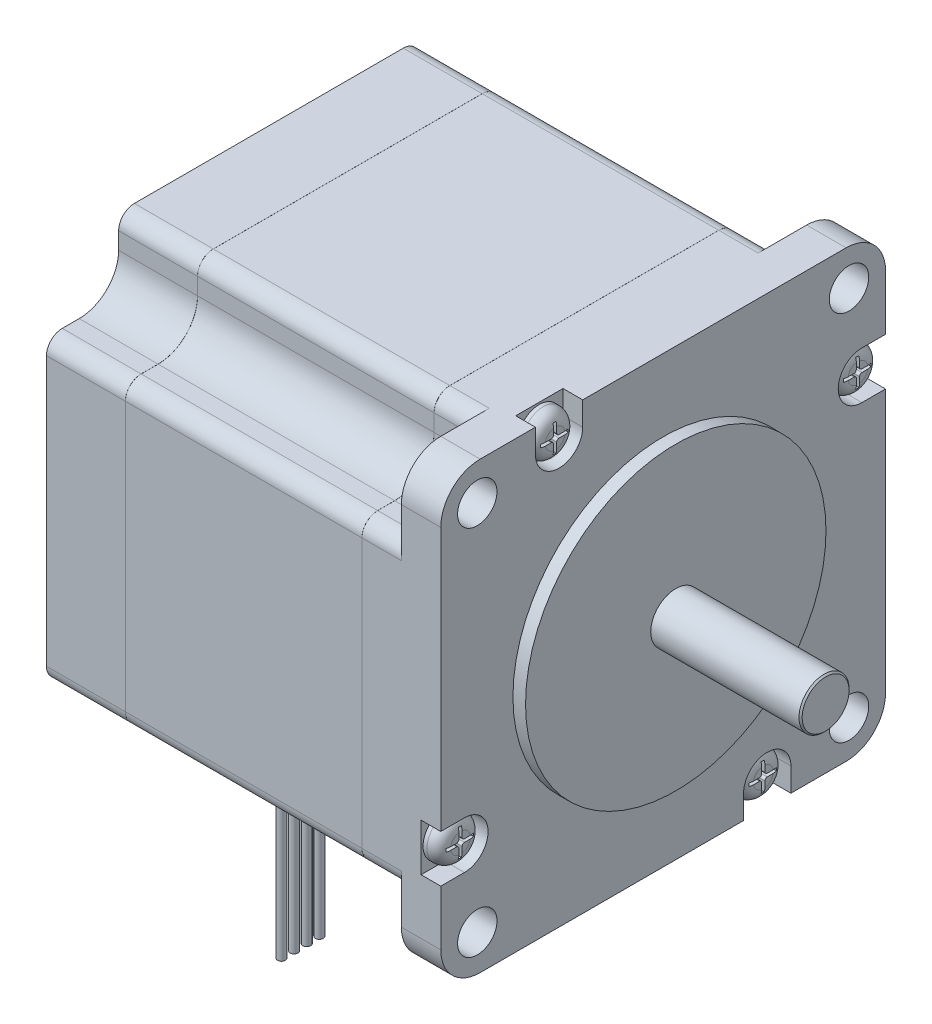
from build123d import *

# Parameters (mm, degrees)
BOSS_EXTRUDE1_DEPTH = 50
CUT_EXTRUDE1_DEPTH  = 45
CUT_EXTRUDE2_DEPTH  = 0.01
CUT_EXTRUDE3_DEPTH  = 0.01
CUT_EXTRUDE4_DEPTH  = 2.5
CUT_EXTRUDE5_DEPTH  = 1
CIRPATTERN1_COUNT   = 4
DIAMETERHOLE1_D     = 5
SKETCH11_W          = 4
SKETCH11_H          = 8
BOSS_EXTRUDE2_DEPTH = 1.8
SKETCH12_R          = 0.5
BOSS_EXTRUDE3_DEPTH = 30


with BuildPart() as part:
    # Sketch1 → Boss-Extrude1 (new body)
    with BuildSketch(Plane(origin=(0, 0, 0), x_dir=(0, 0, -1), z_dir=(1, 0, 0))):
        with BuildLine():
            Line((23.2, -28.2), (-23.2, -28.2))
            ThreePointArc((-23.2, -28.2), (-26.735533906, -26.735533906), (-28.2, -23.2))
            Line((-28.2, -23.2), (-28.2, 23.2))
            ThreePointArc((-28.2, 23.2), (-26.735533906, 26.735533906), (-23.2, 28.2))
            Line((-23.2, 28.2), (23.2, 28.2))
            ThreePointArc((23.2, 28.2), (26.735533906, 26.735533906), (28.2, 23.2))
            Line((28.2, 23.2), (28.2, -23.2))
            ThreePointArc((28.2, -23.2), (26.735533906, -26.735533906), (23.2, -28.2))
        make_face()
    extrude(amount=-BOSS_EXTRUDE1_DEPTH)

    # Sketch2 → Revolve1 (revolve)
    with BuildSketch(Plane.XY, mode=Mode.PRIVATE) as revolve1_sk:
        Polygon((20.4, 3.175), (20.6, 2.975), (20.6, 0), (0, 0), (0, 19.05), (1.6, 19.05), (1.6, 3.175), align=None)
    revolve(revolve1_sk.sketch.rotate(Axis((-43.03, 0, 0), (1, 0, 0)), 90), axis=Axis((-43.03, 0, 0), (1, 0, 0)))

    # Sketch3 → Cut-Extrude1 (cut)
    with BuildSketch(Plane.ZY.offset(50)):
        with BuildLine():
            Line((19.05, 26.2), (19.05, 24.05))
            ThreePointArc((19.05, 24.05), (20.514466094, 20.514466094), (24.05, 19.05))
            Line((24.05, 19.05), (26.2, 19.05))
            ThreePointArc((26.2, 19.05), (27.614213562, 18.464213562), (28.2, 17.05))
            Line((28.2, 17.05), (28.2, 28.2))
            Line((28.2, 28.2), (17.05, 28.2))
            ThreePointArc((17.05, 28.2), (18.464213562, 27.614213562), (19.05, 26.2))
        make_face()
        with BuildLine():
            Line((-28.2, 28.2), (-17.05, 28.2))
            ThreePointArc((-17.05, 28.2), (-18.464213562, 27.614213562), (-19.05, 26.2))
            Line((-19.05, 26.2), (-19.05, 24.05))
            ThreePointArc((-19.05, 24.05), (-20.514466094, 20.514466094), (-24.05, 19.05))
            Line((-24.05, 19.05), (-26.2, 19.05))
            ThreePointArc((-26.2, 19.05), (-27.614213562, 18.464213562), (-28.2, 17.05))
            Line((-28.2, 17.05), (-28.2, 28.2))
        make_face()
        with BuildLine():
            Line((28.2, -28.2), (17.05, -28.2))
            ThreePointArc((17.05, -28.2), (18.464213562, -27.614213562), (19.05, -26.2))
            Line((19.05, -26.2), (19.05, -24.05))
            ThreePointArc((19.05, -24.05), (20.514466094, -20.514466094), (24.05, -19.05))
            Line((24.05, -19.05), (26.2, -19.05))
            ThreePointArc((26.2, -19.05), (27.614213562, -18.464213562), (28.2, -17.05))
            Line((28.2, -17.05), (28.2, -28.2))
        make_face()
        with BuildLine():
            Line((-19.05, -26.2), (-19.05, -24.05))
            ThreePointArc((-19.05, -24.05), (-20.514466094, -20.514466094), (-24.05, -19.05))
            Line((-24.05, -19.05), (-26.2, -19.05))
            ThreePointArc((-26.2, -19.05), (-27.614213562, -18.464213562), (-28.2, -17.05))
            Line((-28.2, -17.05), (-28.2, -28.2))
            Line((-28.2, -28.2), (-17.05, -28.2))
            ThreePointArc((-17.05, -28.2), (-18.464213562, -27.614213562), (-19.05, -26.2))
        make_face()
    extrude(amount=-CUT_EXTRUDE1_DEPTH, mode=Mode.SUBTRACT)

    # Sketch4 → Cut-Extrude2 (cut)
    with BuildSketch(Plane(origin=(-10, 0, 0), x_dir=(0, 0, -1), z_dir=(1, 0, 0))):
        with BuildLine():
            Line((-17.05, -28.2), (17.05, -28.2))
            ThreePointArc((17.05, -28.2), (18.464213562, -27.614213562), (19.05, -26.2))
            Line((19.05, -26.2), (19.05, -24.05))
            ThreePointArc((19.05, -24.05), (20.514466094, -20.514466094), (24.05, -19.05))
            Line((24.05, -19.05), (26.2, -19.05))
            ThreePointArc((26.2, -19.05), (27.614213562, -18.464213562), (28.2, -17.05))
            Line((28.2, -17.05), (28.2, 17.05))
            ThreePointArc((28.2, 17.05), (27.614213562, 18.464213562), (26.2, 19.05))
            Line((26.2, 19.05), (24.05, 19.05))
            ThreePointArc((24.05, 19.05), (20.514466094, 20.514466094), (19.05, 24.05))
            Line((19.05, 24.05), (19.05, 26.2))
            ThreePointArc((19.05, 26.2), (18.464213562, 27.614213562), (17.05, 28.2))
            Line((17.05, 28.2), (-17.05, 28.2))
            ThreePointArc((-17.05, 28.2), (-18.464213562, 27.614213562), (-19.05, 26.2))
            Line((-19.05, 26.2), (-19.05, 24.05))
            ThreePointArc((-19.05, 24.05), (-20.514466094, 20.514466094), (-24.05, 19.05))
            Line((-24.05, 19.05), (-26.2, 19.05))
            ThreePointArc((-26.2, 19.05), (-27.614213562, 18.464213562), (-28.2, 17.05))
            Line((-28.2, 17.05), (-28.2, -17.05))
            ThreePointArc((-28.2, -17.05), (-27.614213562, -18.464213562), (-26.2, -19.05))
            Line((-26.2, -19.05), (-24.05, -19.05))
            ThreePointArc((-24.05, -19.05), (-20.514466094, -20.514466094), (-19.05, -24.05))
            Line((-19.05, -24.05), (-19.05, -26.2))
            ThreePointArc((-19.05, -26.2), (-18.464213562, -27.614213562), (-17.05, -28.2))
        make_face()
        with BuildLine():
            Line((-17.05, -28.15), (17.05, -28.15))
            ThreePointArc((17.05, -28.15), (18.428858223, -27.578858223), (19, -26.2))
            Line((19, -26.2), (19, -24.05))
            ThreePointArc((19, -24.05), (20.479110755, -20.479110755), (24.05, -19))
            Line((24.05, -19), (26.2, -19))
            ThreePointArc((26.2, -19), (27.578858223, -18.428858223), (28.15, -17.05))
            Line((28.15, -17.05), (28.15, 17.05))
            ThreePointArc((28.15, 17.05), (27.578858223, 18.428858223), (26.2, 19))
            Line((26.2, 19), (24.05, 19))
            ThreePointArc((24.05, 19), (20.479110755, 20.479110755), (19, 24.05))
            Line((19, 24.05), (19, 26.2))
            ThreePointArc((19, 26.2), (18.428858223, 27.578858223), (17.05, 28.15))
            Line((17.05, 28.15), (-17.05, 28.15))
            ThreePointArc((-17.05, 28.15), (-18.428858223, 27.578858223), (-19, 26.2))
            Line((-19, 26.2), (-19, 24.05))
            ThreePointArc((-19, 24.05), (-20.479110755, 20.479110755), (-24.05, 19))
            Line((-24.05, 19), (-26.2, 19))
            ThreePointArc((-26.2, 19), (-27.578858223, 18.428858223), (-28.15, 17.05))
            Line((-28.15, 17.05), (-28.15, -17.05))
            ThreePointArc((-28.15, -17.05), (-27.578858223, -18.428858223), (-26.2, -19))
            Line((-26.2, -19), (-24.05, -19))
            ThreePointArc((-24.05, -19), (-20.479110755, -20.479110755), (-19, -24.05))
            Line((-19, -24.05), (-19, -26.2))
            ThreePointArc((-19, -26.2), (-18.428858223, -27.578858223), (-17.05, -28.15))
        make_face(mode=Mode.SUBTRACT)
    extrude(amount=CUT_EXTRUDE2_DEPTH, mode=Mode.SUBTRACT)

    # Sketch5 → Cut-Extrude3 (cut)
    with BuildSketch(Plane.ZY.offset(40)):
        with BuildLine():
            Line((-26.2, -19.05), (-24.05, -19.05))
            ThreePointArc((-24.05, -19.05), (-20.514466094, -20.514466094), (-19.05, -24.05))
            Line((-19.05, -24.05), (-19.05, -26.2))
            ThreePointArc((-19.05, -26.2), (-18.464213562, -27.614213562), (-17.05, -28.2))
            Line((-17.05, -28.2), (17.05, -28.2))
            ThreePointArc((17.05, -28.2), (18.464213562, -27.614213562), (19.05, -26.2))
            Line((19.05, -26.2), (19.05, -24.05))
            ThreePointArc((19.05, -24.05), (20.514466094, -20.514466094), (24.05, -19.05))
            Line((24.05, -19.05), (26.2, -19.05))
            ThreePointArc((26.2, -19.05), (27.614213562, -18.464213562), (28.2, -17.05))
            Line((28.2, -17.05), (28.2, 17.05))
            ThreePointArc((28.2, 17.05), (27.614213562, 18.464213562), (26.2, 19.05))
            Line((26.2, 19.05), (24.05, 19.05))
            ThreePointArc((24.05, 19.05), (20.514466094, 20.514466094), (19.05, 24.05))
            Line((19.05, 24.05), (19.05, 26.2))
            ThreePointArc((19.05, 26.2), (18.464213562, 27.614213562), (17.05, 28.2))
            Line((17.05, 28.2), (-17.05, 28.2))
            ThreePointArc((-17.05, 28.2), (-18.464213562, 27.614213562), (-19.05, 26.2))
            Line((-19.05, 26.2), (-19.05, 24.05))
            ThreePointArc((-19.05, 24.05), (-20.514466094, 20.514466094), (-24.05, 19.05))
            Line((-24.05, 19.05), (-26.2, 19.05))
            ThreePointArc((-26.2, 19.05), (-27.614213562, 18.464213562), (-28.2, 17.05))
            Line((-28.2, 17.05), (-28.2, -17.05))
            ThreePointArc((-28.2, -17.05), (-27.614213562, -18.464213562), (-26.2, -19.05))
        make_face()
        with BuildLine():
            Line((28.15, -17.05), (28.15, 17.05))
            ThreePointArc((28.15, 17.05), (27.578858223, 18.428858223), (26.2, 19))
            Line((26.2, 19), (24.05, 19))
            ThreePointArc((24.05, 19), (20.479110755, 20.479110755), (19, 24.05))
            Line((19, 24.05), (19, 26.2))
            ThreePointArc((19, 26.2), (18.428858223, 27.578858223), (17.05, 28.15))
            Line((17.05, 28.15), (-17.05, 28.15))
            ThreePointArc((-17.05, 28.15), (-18.428858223, 27.578858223), (-19, 26.2))
            Line((-19, 26.2), (-19, 24.05))
            ThreePointArc((-19, 24.05), (-20.479110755, 20.479110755), (-24.05, 19))
            Line((-24.05, 19), (-26.2, 19))
            ThreePointArc((-26.2, 19), (-27.578858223, 18.428858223), (-28.15, 17.05))
            Line((-28.15, 17.05), (-28.15, -17.05))
            ThreePointArc((-28.15, -17.05), (-27.578858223, -18.428858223), (-26.2, -19))
            Line((-26.2, -19), (-24.05, -19))
            ThreePointArc((-24.05, -19), (-20.479110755, -20.479110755), (-19, -24.05))
            Line((-19, -24.05), (-19, -26.2))
            ThreePointArc((-19, -26.2), (-18.428858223, -27.578858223), (-17.05, -28.15))
            Line((-17.05, -28.15), (17.05, -28.15))
            ThreePointArc((17.05, -28.15), (18.428858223, -27.578858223), (19, -26.2))
            Line((19, -26.2), (19, -24.05))
            ThreePointArc((19, -24.05), (20.479110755, -20.479110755), (24.05, -19))
            Line((24.05, -19), (26.2, -19))
            ThreePointArc((26.2, -19), (27.578858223, -18.428858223), (28.15, -17.05))
        make_face(mode=Mode.SUBTRACT)
    extrude(amount=-CUT_EXTRUDE3_DEPTH, mode=Mode.SUBTRACT)

    # Sketch6 → Cut-Extrude4 (cut)
    with BuildSketch(Plane(origin=(0, 0, 0), x_dir=(0, 0, -1), z_dir=(1, 0, 0))):
        with BuildLine():
            Line((-16.2, 25.2), (-16.2, 28.2))
            ThreePointArc((-16.2, 28.2), (-13.2, 31.2), (-10.2, 28.2))
            Line((-10.2, 28.2), (-10.2, 25.2))
            ThreePointArc((-10.2, 25.2), (-13.2, 22.2), (-16.2, 25.2))
        make_face()
        with BuildLine():
            Line((25.2, 16.2), (28.2, 16.2))
            ThreePointArc((28.2, 16.2), (31.2, 13.2), (28.2, 10.2))
            Line((28.2, 10.2), (25.2, 10.2))
            ThreePointArc((25.2, 10.2), (22.2, 13.2), (25.2, 16.2))
        make_face()
        with BuildLine():
            Line((16.2, -25.2), (16.2, -28.2))
            ThreePointArc((16.2, -28.2), (13.2, -31.2), (10.2, -28.2))
            Line((10.2, -28.2), (10.2, -25.2))
            ThreePointArc((10.2, -25.2), (13.2, -22.2), (16.2, -25.2))
        make_face()
        with BuildLine():
            Line((-25.2, -16.2), (-28.2, -16.2))
            ThreePointArc((-28.2, -16.2), (-31.2, -13.2), (-28.2, -10.2))
            Line((-28.2, -10.2), (-25.2, -10.2))
            ThreePointArc((-25.2, -10.2), (-22.2, -13.2), (-25.2, -16.2))
        make_face()
    extrude(amount=-CUT_EXTRUDE4_DEPTH, mode=Mode.SUBTRACT)

    # Sketch7 → Revolve2 (revolve)
    with BuildSketch(Plane(origin=(0, 25.2, 0), x_dir=(1, 0, 0), z_dir=(0, 1, 0)), mode=Mode.PRIVATE) as revolve2_sk:
        with BuildLine():
            Line((-2.5, -13.2), (-0.5, -13.2))
            Line((-0.5, -13.2), (-0.5, -14.45))
            ThreePointArc((-0.5, -14.45), (-0.939339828, -15.510660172), (-2, -15.95))
            Line((-2, -15.95), (-2.5, -15.95))
            Line((-2.5, -15.95), (-2.5, -13.2))
        make_face()
    revolve2 = revolve(revolve2_sk.sketch.rotate(Axis((0, 25.2, 13.2), (-1, 0, 0)), 180), axis=Axis((0, 25.2, 13.2), (-1, 0, 0)))

    # Sketch8 → Cut-Extrude5 (cut)
    with BuildSketch(Plane(origin=(-0.5, 0, 0), x_dir=(0, 0, -1), z_dir=(1, 0, 0))):
        with BuildLine():
            Line((-14.95, 25.4), (-13.7, 25.4))
            ThreePointArc((-13.7, 25.4), (-13.487867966, 25.487867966), (-13.4, 25.7))
            Line((-13.4, 25.7), (-13.4, 26.95))
            Line((-13.4, 26.95), (-13, 26.95))
            Line((-13, 26.95), (-13, 25.7))
            ThreePointArc((-13, 25.7), (-12.912132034, 25.487867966), (-12.7, 25.4))
            Line((-12.7, 25.4), (-11.45, 25.4))
            Line((-11.45, 25.4), (-11.45, 25))
            Line((-11.45, 25), (-12.7, 25))
            ThreePointArc((-12.7, 25), (-12.912132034, 24.912132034), (-13, 24.7))
            Line((-13, 24.7), (-13, 23.45))
            Line((-13, 23.45), (-13.4, 23.45))
            Line((-13.4, 23.45), (-13.4, 24.7))
            ThreePointArc((-13.4, 24.7), (-13.487867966, 24.912132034), (-13.7, 25))
            Line((-13.7, 25), (-14.95, 25))
            Line((-14.95, 25), (-14.95, 25.4))
        make_face()
    cut_extrude5 = extrude(amount=-CUT_EXTRUDE5_DEPTH, mode=Mode.SUBTRACT)

    # CirPattern1: Revolve2, Cut-Extrude5 ×4 about axis
    cirpattern1_axis = Axis((0, 0, 0), (1, 0, 0))
    add([revolve2.rotate(cirpattern1_axis, i * 360 / CIRPATTERN1_COUNT) for i in range(1, CIRPATTERN1_COUNT)])
    add([cut_extrude5.rotate(cirpattern1_axis, i * 360 / CIRPATTERN1_COUNT) for i in range(1, CIRPATTERN1_COUNT)], mode=Mode.SUBTRACT)

    # DiameterHole1 (through all)
    with Locations(Plane(origin=(0, 0, 0), x_dir=(0, 0, -1), z_dir=(1, 0, 0))):
        with Locations((-23.57, 23.57), (23.57, 23.57), (23.57, -23.57), (-23.57, -23.57)):
            Hole(DIAMETERHOLE1_D / 2)

    # Sketch11 → Boss-Extrude2 (add)
    with BuildSketch(Plane.XZ.offset(28.2)):
        with Locations((-46, 0)):
            Rectangle(SKETCH11_W, SKETCH11_H)
    extrude(amount=BOSS_EXTRUDE2_DEPTH)

    # Sketch12 → Boss-Extrude3 (add)
    with BuildSketch(Plane.XZ.offset(30)):
        with Locations(Location((-46, 2.4, 0), (0, 0, 270))):
            Circle(SKETCH12_R)
        with Locations(Location((-46, 0.8, 0), (0, 0, 270))):
            Circle(SKETCH12_R)
        with Locations(Location((-46, -0.8, 0), (0, 0, 270))):
            Circle(SKETCH12_R)
        with Locations(Location((-46, -2.4, 0), (0, 0, 270))):
            Circle(SKETCH12_R)
    extrude(amount=BOSS_EXTRUDE3_DEPTH)


solid = part.part
